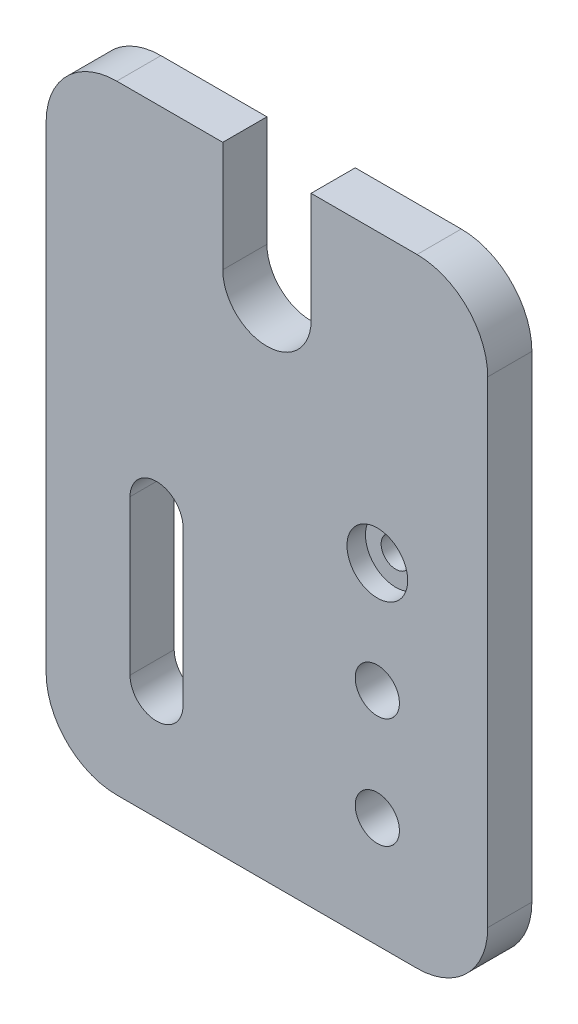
ISO-10303-21;
HEADER;
FILE_DESCRIPTION(('STEP AP214'),'2;1');
FILE_NAME('part.step','',(''),(''),'','','');
FILE_SCHEMA(('AUTOMOTIVE_DESIGN { 1 0 10303 214 1 1 1 1 }'));
ENDSEC;
DATA;
#1=APPLICATION_CONTEXT('core data for automotive mechanical design processes');
#2=APPLICATION_PROTOCOL_DEFINITION('international standard','automotive_design',2000,#1);
#3=PRODUCT_CONTEXT('',#1,'mechanical');
#4=PRODUCT('Part','Part','',(#3));
#5=PRODUCT_RELATED_PRODUCT_CATEGORY('part','',(#4));
#6=PRODUCT_DEFINITION_FORMATION('','',#4);
#7=PRODUCT_DEFINITION_CONTEXT('part definition',#1,'design');
#8=PRODUCT_DEFINITION('design','',#6,#7);
#9=PRODUCT_DEFINITION_SHAPE('','',#8);
#10=(LENGTH_UNIT() NAMED_UNIT(*) SI_UNIT(.MILLI.,.METRE.));
#11=(NAMED_UNIT(*) PLANE_ANGLE_UNIT() SI_UNIT($,.RADIAN.));
#12=(NAMED_UNIT(*) SI_UNIT($,.STERADIAN.) SOLID_ANGLE_UNIT());
#13=UNCERTAINTY_MEASURE_WITH_UNIT(LENGTH_MEASURE(1.E-05),#10,'distance_accuracy_value','');
#14=(GEOMETRIC_REPRESENTATION_CONTEXT(3) GLOBAL_UNCERTAINTY_ASSIGNED_CONTEXT((#13)) GLOBAL_UNIT_ASSIGNED_CONTEXT((#10,
#11,#12)) REPRESENTATION_CONTEXT('',''));
#15=CARTESIAN_POINT('',(0.,0.,0.));
#16=DIRECTION('',(0.,0.,1.));
#17=DIRECTION('',(1.,0.,0.));
#18=AXIS2_PLACEMENT_3D('',#15,#16,#17);
#19=CARTESIAN_POINT('',(-63.5,88.9,6.35));
#20=DIRECTION('',(0.,-1.,0.));
#21=DIRECTION('',(0.,0.,-1.));
#22=AXIS2_PLACEMENT_3D('',#19,#20,#21);
#23=PLANE('',#22);
#24=DIRECTION('',(-1.,0.,0.));
#25=VECTOR('',#24,1.);
#26=CARTESIAN_POINT('',(-63.5,88.9,-6.35));
#27=LINE('',#26,#25);
#28=CARTESIAN_POINT('',(43.18,88.9,-6.35));
#29=VERTEX_POINT('',#28);
#30=CARTESIAN_POINT('',(12.7,88.9,-6.35));
#31=VERTEX_POINT('',#30);
#32=EDGE_CURVE('E230',#29,#31,#27,.T.);
#33=ORIENTED_EDGE('',*,*,#32,.T.);
#34=DIRECTION('',(0.,0.,1.));
#35=VECTOR('',#34,1.);
#36=CARTESIAN_POINT('',(12.7,88.9,-6.35));
#37=LINE('',#36,#35);
#38=CARTESIAN_POINT('',(12.7,88.9,6.35));
#39=VERTEX_POINT('',#38);
#40=EDGE_CURVE('E212',#31,#39,#37,.T.);
#41=ORIENTED_EDGE('',*,*,#40,.T.);
#42=DIRECTION('',(-1.,0.,0.));
#43=VECTOR('',#42,1.);
#44=CARTESIAN_POINT('',(-63.5,88.9,6.35));
#45=LINE('',#44,#43);
#46=CARTESIAN_POINT('',(43.18,88.9,6.35));
#47=VERTEX_POINT('',#46);
#48=EDGE_CURVE('E243',#47,#39,#45,.T.);
#49=ORIENTED_EDGE('',*,*,#48,.F.);
#50=DIRECTION('',(0.,0.,-1.));
#51=VECTOR('',#50,1.);
#52=CARTESIAN_POINT('',(43.18,88.9,6.35));
#53=LINE('',#52,#51);
#54=EDGE_CURVE('E273',#47,#29,#53,.T.);
#55=ORIENTED_EDGE('',*,*,#54,.T.);
#56=EDGE_LOOP('',(#33,#41,#49,#55));
#57=FACE_BOUND('',#56,.T.);
#58=ADVANCED_FACE('F24',(#57),#23,.F.);
#59=CARTESIAN_POINT('',(-63.5,88.9,6.35));
#60=DIRECTION('',(1.,0.,0.));
#61=DIRECTION('',(0.,1.,0.));
#62=AXIS2_PLACEMENT_3D('',#59,#60,#61);
#63=PLANE('',#62);
#64=DIRECTION('',(0.,-1.,0.));
#65=VECTOR('',#64,1.);
#66=CARTESIAN_POINT('',(-63.5,88.9,-6.35));
#67=LINE('',#66,#65);
#68=CARTESIAN_POINT('',(-63.5,68.58,-6.35));
#69=VERTEX_POINT('',#68);
#70=CARTESIAN_POINT('',(-63.5,-68.58,-6.35));
#71=VERTEX_POINT('',#70);
#72=EDGE_CURVE('E215',#69,#71,#67,.T.);
#73=ORIENTED_EDGE('',*,*,#72,.T.);
#74=DIRECTION('',(0.,0.,-1.));
#75=VECTOR('',#74,1.);
#76=CARTESIAN_POINT('',(-63.5,-68.58,6.35));
#77=LINE('',#76,#75);
#78=CARTESIAN_POINT('',(-63.5,-68.58,6.35));
#79=VERTEX_POINT('',#78);
#80=EDGE_CURVE('E263',#71,#79,#77,.F.);
#81=ORIENTED_EDGE('',*,*,#80,.T.);
#82=DIRECTION('',(0.,-1.,0.));
#83=VECTOR('',#82,1.);
#84=CARTESIAN_POINT('',(-63.5,88.9,6.35));
#85=LINE('',#84,#83);
#86=CARTESIAN_POINT('',(-63.5,68.58,6.35));
#87=VERTEX_POINT('',#86);
#88=EDGE_CURVE('E233',#87,#79,#85,.T.);
#89=ORIENTED_EDGE('',*,*,#88,.F.);
#90=DIRECTION('',(0.,0.,-1.));
#91=VECTOR('',#90,1.);
#92=CARTESIAN_POINT('',(-63.5,68.58,6.35));
#93=LINE('',#92,#91);
#94=EDGE_CURVE('E260',#87,#69,#93,.T.);
#95=ORIENTED_EDGE('',*,*,#94,.T.);
#96=EDGE_LOOP('',(#73,#81,#89,#95));
#97=FACE_BOUND('',#96,.T.);
#98=ADVANCED_FACE('F26',(#97),#63,.F.);
#99=CARTESIAN_POINT('',(-63.5,-88.9,6.35));
#100=DIRECTION('',(0.,1.,0.));
#101=DIRECTION('',(0.,0.,1.));
#102=AXIS2_PLACEMENT_3D('',#99,#100,#101);
#103=PLANE('',#102);
#104=DIRECTION('',(1.,0.,0.));
#105=VECTOR('',#104,1.);
#106=CARTESIAN_POINT('',(-63.5,-88.9,6.35));
#107=LINE('',#106,#105);
#108=CARTESIAN_POINT('',(-43.18,-88.9,6.35));
#109=VERTEX_POINT('',#108);
#110=CARTESIAN_POINT('',(43.18,-88.9,6.35));
#111=VERTEX_POINT('',#110);
#112=EDGE_CURVE('E236',#109,#111,#107,.T.);
#113=ORIENTED_EDGE('',*,*,#112,.F.);
#114=DIRECTION('',(0.,0.,-1.));
#115=VECTOR('',#114,1.);
#116=CARTESIAN_POINT('',(-43.18,-88.9,6.35));
#117=LINE('',#116,#115);
#118=CARTESIAN_POINT('',(-43.18,-88.9,-6.35));
#119=VERTEX_POINT('',#118);
#120=EDGE_CURVE('E248',#109,#119,#117,.T.);
#121=ORIENTED_EDGE('',*,*,#120,.T.);
#122=DIRECTION('',(1.,0.,0.));
#123=VECTOR('',#122,1.);
#124=CARTESIAN_POINT('',(-63.5,-88.9,-6.35));
#125=LINE('',#124,#123);
#126=CARTESIAN_POINT('',(43.18,-88.9,-6.35));
#127=VERTEX_POINT('',#126);
#128=EDGE_CURVE('E223',#119,#127,#125,.T.);
#129=ORIENTED_EDGE('',*,*,#128,.T.);
#130=DIRECTION('',(0.,0.,-1.));
#131=VECTOR('',#130,1.);
#132=CARTESIAN_POINT('',(43.18,-88.9,6.35));
#133=LINE('',#132,#131);
#134=EDGE_CURVE('E246',#127,#111,#133,.F.);
#135=ORIENTED_EDGE('',*,*,#134,.T.);
#136=EDGE_LOOP('',(#113,#121,#129,#135));
#137=FACE_BOUND('',#136,.T.);
#138=ADVANCED_FACE('F305',(#137),#103,.F.);
#139=CARTESIAN_POINT('',(63.5,88.9,6.35));
#140=DIRECTION('',(-1.,0.,0.));
#141=DIRECTION('',(0.,-1.,0.));
#142=AXIS2_PLACEMENT_3D('',#139,#140,#141);
#143=PLANE('',#142);
#144=DIRECTION('',(0.,1.,0.));
#145=VECTOR('',#144,1.);
#146=CARTESIAN_POINT('',(63.5,88.9,-6.35));
#147=LINE('',#146,#145);
#148=CARTESIAN_POINT('',(63.5,-68.58,-6.35));
#149=VERTEX_POINT('',#148);
#150=CARTESIAN_POINT('',(63.5,68.58,-6.35));
#151=VERTEX_POINT('',#150);
#152=EDGE_CURVE('E226',#149,#151,#147,.T.);
#153=ORIENTED_EDGE('',*,*,#152,.T.);
#154=DIRECTION('',(0.,0.,-1.));
#155=VECTOR('',#154,1.);
#156=CARTESIAN_POINT('',(63.5,68.58,6.35));
#157=LINE('',#156,#155);
#158=CARTESIAN_POINT('',(63.5,68.58,6.35));
#159=VERTEX_POINT('',#158);
#160=EDGE_CURVE('E11',#151,#159,#157,.F.);
#161=ORIENTED_EDGE('',*,*,#160,.T.);
#162=DIRECTION('',(0.,1.,0.));
#163=VECTOR('',#162,1.);
#164=CARTESIAN_POINT('',(63.5,88.9,6.35));
#165=LINE('',#164,#163);
#166=CARTESIAN_POINT('',(63.5,-68.58,6.35));
#167=VERTEX_POINT('',#166);
#168=EDGE_CURVE('E239',#167,#159,#165,.T.);
#169=ORIENTED_EDGE('',*,*,#168,.F.);
#170=DIRECTION('',(0.,0.,-1.));
#171=VECTOR('',#170,1.);
#172=CARTESIAN_POINT('',(63.5,-68.58,6.35));
#173=LINE('',#172,#171);
#174=EDGE_CURVE('E33',#167,#149,#173,.T.);
#175=ORIENTED_EDGE('',*,*,#174,.T.);
#176=EDGE_LOOP('',(#153,#161,#169,#175));
#177=FACE_BOUND('',#176,.T.);
#178=ADVANCED_FACE('F284',(#177),#143,.F.);
#179=CARTESIAN_POINT('',(-12.7,88.9,6.35));
#180=VERTEX_POINT('',#179);
#181=CARTESIAN_POINT('',(-43.18,88.9,6.35));
#182=VERTEX_POINT('',#181);
#183=EDGE_CURVE('E242',#180,#182,#45,.T.);
#184=ORIENTED_EDGE('',*,*,#183,.F.);
#185=DIRECTION('',(0.,0.,1.));
#186=VECTOR('',#185,1.);
#187=CARTESIAN_POINT('',(-12.7,88.9,-6.35));
#188=LINE('',#187,#186);
#189=CARTESIAN_POINT('',(-12.7,88.9,-6.35));
#190=VERTEX_POINT('',#189);
#191=EDGE_CURVE('E211',#190,#180,#188,.T.);
#192=ORIENTED_EDGE('',*,*,#191,.F.);
#193=CARTESIAN_POINT('',(-43.18,88.9,-6.35));
#194=VERTEX_POINT('',#193);
#195=EDGE_CURVE('E229',#190,#194,#27,.T.);
#196=ORIENTED_EDGE('',*,*,#195,.T.);
#197=DIRECTION('',(0.,0.,-1.));
#198=VECTOR('',#197,1.);
#199=CARTESIAN_POINT('',(-43.18,88.9,6.35));
#200=LINE('',#199,#198);
#201=EDGE_CURVE('E276',#194,#182,#200,.F.);
#202=ORIENTED_EDGE('',*,*,#201,.T.);
#203=EDGE_LOOP('',(#184,#192,#196,#202));
#204=FACE_BOUND('',#203,.T.);
#205=ADVANCED_FACE('F323',(#204),#23,.F.);
#206=CARTESIAN_POINT('',(-63.5,-88.9,6.35));
#207=DIRECTION('',(0.,0.,1.));
#208=DIRECTION('',(1.,0.,0.));
#209=AXIS2_PLACEMENT_3D('',#206,#207,#208);
#210=PLANE('',#209);
#211=CARTESIAN_POINT('',(-31.75,-12.7,6.35));
#212=DIRECTION('',(0.,0.,1.));
#213=DIRECTION('',(1.,0.,0.));
#214=AXIS2_PLACEMENT_3D('',#211,#212,#213);
#215=CIRCLE('',#214,7.62);
#216=CARTESIAN_POINT('',(-24.13,-12.7,6.35));
#217=VERTEX_POINT('',#216);
#218=CARTESIAN_POINT('',(-39.37,-12.7,6.35));
#219=VERTEX_POINT('',#218);
#220=EDGE_CURVE('E40',#217,#219,#215,.T.);
#221=ORIENTED_EDGE('',*,*,#220,.F.);
#222=DIRECTION('',(0.,1.,0.));
#223=VECTOR('',#222,1.);
#224=CARTESIAN_POINT('',(-24.13,-57.15,6.35));
#225=LINE('',#224,#223);
#226=CARTESIAN_POINT('',(-24.13,-57.15,6.35));
#227=VERTEX_POINT('',#226);
#228=EDGE_CURVE('E155',#227,#217,#225,.T.);
#229=ORIENTED_EDGE('',*,*,#228,.F.);
#230=CARTESIAN_POINT('',(-31.75,-57.15,6.35));
#231=DIRECTION('',(0.,0.,1.));
#232=DIRECTION('',(1.,0.,0.));
#233=AXIS2_PLACEMENT_3D('',#230,#231,#232);
#234=CIRCLE('',#233,7.62);
#235=CARTESIAN_POINT('',(-39.37,-57.15,6.35));
#236=VERTEX_POINT('',#235);
#237=EDGE_CURVE('E139',#236,#227,#234,.T.);
#238=ORIENTED_EDGE('',*,*,#237,.F.);
#239=DIRECTION('',(0.,-1.,0.));
#240=VECTOR('',#239,1.);
#241=CARTESIAN_POINT('',(-39.37,-12.7,6.35));
#242=LINE('',#241,#240);
#243=EDGE_CURVE('E148',#219,#236,#242,.T.);
#244=ORIENTED_EDGE('',*,*,#243,.F.);
#245=EDGE_LOOP('',(#221,#229,#238,#244));
#246=FACE_BOUND('',#245,.T.);
#247=CARTESIAN_POINT('',(31.75,6.34999999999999,6.35));
#248=DIRECTION('',(0.,0.,1.));
#249=DIRECTION('',(1.,0.,0.));
#250=AXIS2_PLACEMENT_3D('',#247,#248,#249);
#251=CIRCLE('',#250,8.73125);
#252=CARTESIAN_POINT('',(40.48125,6.34999999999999,6.35));
#253=VERTEX_POINT('',#252);
#254=EDGE_CURVE('E179',#253,#253,#251,.T.);
#255=ORIENTED_EDGE('',*,*,#254,.F.);
#256=EDGE_LOOP('',(#255));
#257=FACE_BOUND('',#256,.T.);
#258=CARTESIAN_POINT('',(31.75,-57.15,6.35));
#259=DIRECTION('',(0.,0.,1.));
#260=DIRECTION('',(1.,0.,0.));
#261=AXIS2_PLACEMENT_3D('',#258,#259,#260);
#262=CIRCLE('',#261,6.35);
#263=CARTESIAN_POINT('',(38.1,-57.15,6.35));
#264=VERTEX_POINT('',#263);
#265=EDGE_CURVE('E182',#264,#264,#262,.T.);
#266=ORIENTED_EDGE('',*,*,#265,.F.);
#267=EDGE_LOOP('',(#266));
#268=FACE_BOUND('',#267,.T.);
#269=CARTESIAN_POINT('',(31.75,-25.4,6.35));
#270=DIRECTION('',(0.,0.,1.));
#271=DIRECTION('',(1.,0.,0.));
#272=AXIS2_PLACEMENT_3D('',#269,#270,#271);
#273=CIRCLE('',#272,6.35);
#274=CARTESIAN_POINT('',(38.1,-25.4,6.35));
#275=VERTEX_POINT('',#274);
#276=EDGE_CURVE('E188',#275,#275,#273,.T.);
#277=ORIENTED_EDGE('',*,*,#276,.F.);
#278=EDGE_LOOP('',(#277));
#279=FACE_BOUND('',#278,.T.);
#280=DIRECTION('',(0.,1.,0.));
#281=VECTOR('',#280,1.);
#282=CARTESIAN_POINT('',(12.7,57.15,6.35));
#283=LINE('',#282,#281);
#284=CARTESIAN_POINT('',(12.7,57.15,6.35));
#285=VERTEX_POINT('',#284);
#286=EDGE_CURVE('E200',#285,#39,#283,.T.);
#287=ORIENTED_EDGE('',*,*,#286,.F.);
#288=CARTESIAN_POINT('',(0.,57.15,6.35));
#289=DIRECTION('',(0.,0.,1.));
#290=DIRECTION('',(1.,0.,0.));
#291=AXIS2_PLACEMENT_3D('',#288,#289,#290);
#292=CIRCLE('',#291,12.7);
#293=CARTESIAN_POINT('',(-12.7,57.15,6.35));
#294=VERTEX_POINT('',#293);
#295=EDGE_CURVE('E197',#294,#285,#292,.T.);
#296=ORIENTED_EDGE('',*,*,#295,.F.);
#297=DIRECTION('',(0.,-1.,0.));
#298=VECTOR('',#297,1.);
#299=CARTESIAN_POINT('',(-12.7,88.9,6.35));
#300=LINE('',#299,#298);
#301=EDGE_CURVE('E194',#180,#294,#300,.T.);
#302=ORIENTED_EDGE('',*,*,#301,.F.);
#303=ORIENTED_EDGE('',*,*,#183,.T.);
#304=CARTESIAN_POINT('',(-43.18,68.58,6.35));
#305=DIRECTION('',(0.,0.,1.));
#306=DIRECTION('',(1.,0.,0.));
#307=AXIS2_PLACEMENT_3D('',#304,#305,#306);
#308=CIRCLE('',#307,20.32);
#309=EDGE_CURVE('E269',#182,#87,#308,.T.);
#310=ORIENTED_EDGE('',*,*,#309,.T.);
#311=ORIENTED_EDGE('',*,*,#88,.T.);
#312=CARTESIAN_POINT('',(-43.18,-68.58,6.35));
#313=DIRECTION('',(0.,0.,1.));
#314=DIRECTION('',(1.,0.,0.));
#315=AXIS2_PLACEMENT_3D('',#312,#313,#314);
#316=CIRCLE('',#315,20.32);
#317=EDGE_CURVE('E271',#79,#109,#316,.T.);
#318=ORIENTED_EDGE('',*,*,#317,.T.);
#319=ORIENTED_EDGE('',*,*,#112,.T.);
#320=CARTESIAN_POINT('',(43.18,-68.58,6.35));
#321=DIRECTION('',(0.,0.,1.));
#322=DIRECTION('',(1.,0.,0.));
#323=AXIS2_PLACEMENT_3D('',#320,#321,#322);
#324=CIRCLE('',#323,20.32);
#325=EDGE_CURVE('E265',#111,#167,#324,.T.);
#326=ORIENTED_EDGE('',*,*,#325,.T.);
#327=ORIENTED_EDGE('',*,*,#168,.T.);
#328=CARTESIAN_POINT('',(43.18,68.58,6.35));
#329=DIRECTION('',(0.,0.,1.));
#330=DIRECTION('',(1.,0.,0.));
#331=AXIS2_PLACEMENT_3D('',#328,#329,#330);
#332=CIRCLE('',#331,20.32);
#333=EDGE_CURVE('E267',#159,#47,#332,.T.);
#334=ORIENTED_EDGE('',*,*,#333,.T.);
#335=ORIENTED_EDGE('',*,*,#48,.T.);
#336=EDGE_LOOP('',(#287,#296,#302,#303,#310,#311,#318,#319,#326,#327,#334,#335));
#337=FACE_BOUND('',#336,.T.);
#338=ADVANCED_FACE('F152',(#246,#257,#268,#279,#337),#210,.T.);
#339=CARTESIAN_POINT('',(-63.5,-88.9,-6.35));
#340=DIRECTION('',(0.,0.,1.));
#341=DIRECTION('',(1.,0.,0.));
#342=AXIS2_PLACEMENT_3D('',#339,#340,#341);
#343=PLANE('',#342);
#344=DIRECTION('',(0.,1.,0.));
#345=VECTOR('',#344,1.);
#346=CARTESIAN_POINT('',(-24.13,-57.15,-6.35));
#347=LINE('',#346,#345);
#348=CARTESIAN_POINT('',(-24.13,-57.15,-6.35));
#349=VERTEX_POINT('',#348);
#350=CARTESIAN_POINT('',(-24.13,-12.7,-6.35));
#351=VERTEX_POINT('',#350);
#352=EDGE_CURVE('E166',#349,#351,#347,.T.);
#353=ORIENTED_EDGE('',*,*,#352,.T.);
#354=CARTESIAN_POINT('',(-31.75,-12.7,-6.35));
#355=DIRECTION('',(0.,0.,1.));
#356=DIRECTION('',(1.,0.,0.));
#357=AXIS2_PLACEMENT_3D('',#354,#355,#356);
#358=CIRCLE('',#357,7.62);
#359=CARTESIAN_POINT('',(-39.37,-12.7,-6.35));
#360=VERTEX_POINT('',#359);
#361=EDGE_CURVE('E157',#351,#360,#358,.T.);
#362=ORIENTED_EDGE('',*,*,#361,.T.);
#363=DIRECTION('',(0.,-1.,0.));
#364=VECTOR('',#363,1.);
#365=CARTESIAN_POINT('',(-39.37,-12.7,-6.35));
#366=LINE('',#365,#364);
#367=CARTESIAN_POINT('',(-39.37,-57.15,-6.35));
#368=VERTEX_POINT('',#367);
#369=EDGE_CURVE('E163',#360,#368,#366,.T.);
#370=ORIENTED_EDGE('',*,*,#369,.T.);
#371=CARTESIAN_POINT('',(-31.75,-57.15,-6.35));
#372=DIRECTION('',(0.,0.,1.));
#373=DIRECTION('',(1.,0.,0.));
#374=AXIS2_PLACEMENT_3D('',#371,#372,#373);
#375=CIRCLE('',#374,7.62);
#376=EDGE_CURVE('E48',#368,#349,#375,.T.);
#377=ORIENTED_EDGE('',*,*,#376,.T.);
#378=EDGE_LOOP('',(#353,#362,#370,#377));
#379=FACE_BOUND('',#378,.T.);
#380=CARTESIAN_POINT('',(31.75,6.34999999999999,-6.35));
#381=DIRECTION('',(0.,0.,1.));
#382=DIRECTION('',(1.,0.,0.));
#383=AXIS2_PLACEMENT_3D('',#380,#381,#382);
#384=CIRCLE('',#383,4.21639999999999);
#385=CARTESIAN_POINT('',(35.9664,6.34999999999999,-6.35));
#386=VERTEX_POINT('',#385);
#387=EDGE_CURVE('E28',#386,#386,#384,.T.);
#388=ORIENTED_EDGE('',*,*,#387,.T.);
#389=EDGE_LOOP('',(#388));
#390=FACE_BOUND('',#389,.T.);
#391=CARTESIAN_POINT('',(31.75,-57.15,-6.35));
#392=DIRECTION('',(0.,0.,1.));
#393=DIRECTION('',(1.,0.,0.));
#394=AXIS2_PLACEMENT_3D('',#391,#392,#393);
#395=CIRCLE('',#394,6.35);
#396=CARTESIAN_POINT('',(38.1,-57.15,-6.35));
#397=VERTEX_POINT('',#396);
#398=EDGE_CURVE('E185',#397,#397,#395,.T.);
#399=ORIENTED_EDGE('',*,*,#398,.T.);
#400=EDGE_LOOP('',(#399));
#401=FACE_BOUND('',#400,.T.);
#402=CARTESIAN_POINT('',(31.75,-25.4,-6.35));
#403=DIRECTION('',(0.,0.,1.));
#404=DIRECTION('',(1.,0.,0.));
#405=AXIS2_PLACEMENT_3D('',#402,#403,#404);
#406=CIRCLE('',#405,6.35);
#407=CARTESIAN_POINT('',(38.1,-25.4,-6.35));
#408=VERTEX_POINT('',#407);
#409=EDGE_CURVE('E191',#408,#408,#406,.T.);
#410=ORIENTED_EDGE('',*,*,#409,.T.);
#411=EDGE_LOOP('',(#410));
#412=FACE_BOUND('',#411,.T.);
#413=CARTESIAN_POINT('',(0.,57.15,-6.35));
#414=DIRECTION('',(0.,0.,1.));
#415=DIRECTION('',(1.,0.,0.));
#416=AXIS2_PLACEMENT_3D('',#413,#414,#415);
#417=CIRCLE('',#416,12.7);
#418=CARTESIAN_POINT('',(-12.7,57.15,-6.35));
#419=VERTEX_POINT('',#418);
#420=CARTESIAN_POINT('',(12.7,57.15,-6.35));
#421=VERTEX_POINT('',#420);
#422=EDGE_CURVE('E205',#419,#421,#417,.T.);
#423=ORIENTED_EDGE('',*,*,#422,.T.);
#424=DIRECTION('',(0.,1.,0.));
#425=VECTOR('',#424,1.);
#426=CARTESIAN_POINT('',(12.7,57.15,-6.35));
#427=LINE('',#426,#425);
#428=EDGE_CURVE('E208',#421,#31,#427,.T.);
#429=ORIENTED_EDGE('',*,*,#428,.T.);
#430=ORIENTED_EDGE('',*,*,#32,.F.);
#431=CARTESIAN_POINT('',(43.18,68.58,-6.35));
#432=DIRECTION('',(0.,0.,1.));
#433=DIRECTION('',(1.,0.,0.));
#434=AXIS2_PLACEMENT_3D('',#431,#432,#433);
#435=CIRCLE('',#434,20.32);
#436=EDGE_CURVE('E253',#29,#151,#435,.F.);
#437=ORIENTED_EDGE('',*,*,#436,.T.);
#438=ORIENTED_EDGE('',*,*,#152,.F.);
#439=CARTESIAN_POINT('',(43.18,-68.58,-6.35));
#440=DIRECTION('',(0.,0.,1.));
#441=DIRECTION('',(1.,0.,0.));
#442=AXIS2_PLACEMENT_3D('',#439,#440,#441);
#443=CIRCLE('',#442,20.32);
#444=EDGE_CURVE('E251',#149,#127,#443,.F.);
#445=ORIENTED_EDGE('',*,*,#444,.T.);
#446=ORIENTED_EDGE('',*,*,#128,.F.);
#447=CARTESIAN_POINT('',(-43.18,-68.58,-6.35));
#448=DIRECTION('',(0.,0.,1.));
#449=DIRECTION('',(1.,0.,0.));
#450=AXIS2_PLACEMENT_3D('',#447,#448,#449);
#451=CIRCLE('',#450,20.32);
#452=EDGE_CURVE('E258',#119,#71,#451,.F.);
#453=ORIENTED_EDGE('',*,*,#452,.T.);
#454=ORIENTED_EDGE('',*,*,#72,.F.);
#455=CARTESIAN_POINT('',(-43.18,68.58,-6.35));
#456=DIRECTION('',(0.,0.,1.));
#457=DIRECTION('',(1.,0.,0.));
#458=AXIS2_PLACEMENT_3D('',#455,#456,#457);
#459=CIRCLE('',#458,20.32);
#460=EDGE_CURVE('E255',#69,#194,#459,.F.);
#461=ORIENTED_EDGE('',*,*,#460,.T.);
#462=ORIENTED_EDGE('',*,*,#195,.F.);
#463=DIRECTION('',(0.,-1.,0.));
#464=VECTOR('',#463,1.);
#465=CARTESIAN_POINT('',(-12.7,88.9,-6.35));
#466=LINE('',#465,#464);
#467=EDGE_CURVE('E202',#190,#419,#466,.T.);
#468=ORIENTED_EDGE('',*,*,#467,.T.);
#469=EDGE_LOOP('',(#423,#429,#430,#437,#438,#445,#446,#453,#454,#461,#462,#468));
#470=FACE_BOUND('',#469,.T.);
#471=ADVANCED_FACE('F289',(#379,#390,#401,#412,#470),#343,.F.);
#472=CARTESIAN_POINT('',(-43.18,-68.58,6.35));
#473=DIRECTION('',(0.,0.,-1.));
#474=DIRECTION('',(-1.,0.,0.));
#475=AXIS2_PLACEMENT_3D('',#472,#473,#474);
#476=CYLINDRICAL_SURFACE('',#475,20.32);
#477=ORIENTED_EDGE('',*,*,#317,.F.);
#478=ORIENTED_EDGE('',*,*,#80,.F.);
#479=ORIENTED_EDGE('',*,*,#452,.F.);
#480=ORIENTED_EDGE('',*,*,#120,.F.);
#481=EDGE_LOOP('',(#477,#478,#479,#480));
#482=FACE_BOUND('',#481,.T.);
#483=ADVANCED_FACE('F314',(#482),#476,.T.);
#484=CARTESIAN_POINT('',(-43.18,68.58,6.35));
#485=DIRECTION('',(0.,0.,-1.));
#486=DIRECTION('',(-1.,0.,0.));
#487=AXIS2_PLACEMENT_3D('',#484,#485,#486);
#488=CYLINDRICAL_SURFACE('',#487,20.32);
#489=ORIENTED_EDGE('',*,*,#309,.F.);
#490=ORIENTED_EDGE('',*,*,#201,.F.);
#491=ORIENTED_EDGE('',*,*,#460,.F.);
#492=ORIENTED_EDGE('',*,*,#94,.F.);
#493=EDGE_LOOP('',(#489,#490,#491,#492));
#494=FACE_BOUND('',#493,.T.);
#495=ADVANCED_FACE('F317',(#494),#488,.T.);
#496=CARTESIAN_POINT('',(43.18,68.58,6.35));
#497=DIRECTION('',(0.,0.,-1.));
#498=DIRECTION('',(-1.,0.,0.));
#499=AXIS2_PLACEMENT_3D('',#496,#497,#498);
#500=CYLINDRICAL_SURFACE('',#499,20.32);
#501=ORIENTED_EDGE('',*,*,#333,.F.);
#502=ORIENTED_EDGE('',*,*,#160,.F.);
#503=ORIENTED_EDGE('',*,*,#436,.F.);
#504=ORIENTED_EDGE('',*,*,#54,.F.);
#505=EDGE_LOOP('',(#501,#502,#503,#504));
#506=FACE_BOUND('',#505,.T.);
#507=ADVANCED_FACE('F295',(#506),#500,.T.);
#508=CARTESIAN_POINT('',(43.18,-68.58,6.35));
#509=DIRECTION('',(0.,0.,-1.));
#510=DIRECTION('',(-1.,0.,0.));
#511=AXIS2_PLACEMENT_3D('',#508,#509,#510);
#512=CYLINDRICAL_SURFACE('',#511,20.32);
#513=ORIENTED_EDGE('',*,*,#325,.F.);
#514=ORIENTED_EDGE('',*,*,#134,.F.);
#515=ORIENTED_EDGE('',*,*,#444,.F.);
#516=ORIENTED_EDGE('',*,*,#174,.F.);
#517=EDGE_LOOP('',(#513,#514,#515,#516));
#518=FACE_BOUND('',#517,.T.);
#519=ADVANCED_FACE('F303',(#518),#512,.T.);
#520=CARTESIAN_POINT('',(12.7,57.15,-6.35));
#521=DIRECTION('',(1.,0.,0.));
#522=DIRECTION('',(0.,0.,-1.));
#523=AXIS2_PLACEMENT_3D('',#520,#521,#522);
#524=PLANE('',#523);
#525=ORIENTED_EDGE('',*,*,#286,.T.);
#526=ORIENTED_EDGE('',*,*,#40,.F.);
#527=ORIENTED_EDGE('',*,*,#428,.F.);
#528=DIRECTION('',(0.,0.,1.));
#529=VECTOR('',#528,1.);
#530=CARTESIAN_POINT('',(12.7,57.15,-6.35));
#531=LINE('',#530,#529);
#532=EDGE_CURVE('E216',#421,#285,#531,.T.);
#533=ORIENTED_EDGE('',*,*,#532,.T.);
#534=EDGE_LOOP('',(#525,#526,#527,#533));
#535=FACE_BOUND('',#534,.T.);
#536=ADVANCED_FACE('F332',(#535),#524,.F.);
#537=CARTESIAN_POINT('',(0.,57.15,-6.35));
#538=DIRECTION('',(0.,0.,1.));
#539=DIRECTION('',(1.,0.,0.));
#540=AXIS2_PLACEMENT_3D('',#537,#538,#539);
#541=CYLINDRICAL_SURFACE('',#540,12.7);
#542=ORIENTED_EDGE('',*,*,#295,.T.);
#543=ORIENTED_EDGE('',*,*,#532,.F.);
#544=ORIENTED_EDGE('',*,*,#422,.F.);
#545=DIRECTION('',(0.,0.,1.));
#546=VECTOR('',#545,1.);
#547=CARTESIAN_POINT('',(-12.7,57.15,-6.35));
#548=LINE('',#547,#546);
#549=EDGE_CURVE('E218',#419,#294,#548,.T.);
#550=ORIENTED_EDGE('',*,*,#549,.T.);
#551=EDGE_LOOP('',(#542,#543,#544,#550));
#552=FACE_BOUND('',#551,.T.);
#553=ADVANCED_FACE('F329',(#552),#541,.F.);
#554=CARTESIAN_POINT('',(-12.7,88.9,-6.35));
#555=DIRECTION('',(-1.,0.,0.));
#556=DIRECTION('',(0.,-1.,0.));
#557=AXIS2_PLACEMENT_3D('',#554,#555,#556);
#558=PLANE('',#557);
#559=ORIENTED_EDGE('',*,*,#301,.T.);
#560=ORIENTED_EDGE('',*,*,#549,.F.);
#561=ORIENTED_EDGE('',*,*,#467,.F.);
#562=ORIENTED_EDGE('',*,*,#191,.T.);
#563=EDGE_LOOP('',(#559,#560,#561,#562));
#564=FACE_BOUND('',#563,.T.);
#565=ADVANCED_FACE('F326',(#564),#558,.F.);
#566=CARTESIAN_POINT('',(31.75,-25.4,-6.35));
#567=DIRECTION('',(0.,0.,1.));
#568=DIRECTION('',(1.,0.,0.));
#569=AXIS2_PLACEMENT_3D('',#566,#567,#568);
#570=CYLINDRICAL_SURFACE('',#569,6.35);
#571=ORIENTED_EDGE('',*,*,#409,.F.);
#572=EDGE_LOOP('',(#571));
#573=FACE_BOUND('',#572,.T.);
#574=ORIENTED_EDGE('',*,*,#276,.T.);
#575=EDGE_LOOP('',(#574));
#576=FACE_BOUND('',#575,.T.);
#577=ADVANCED_FACE('F417',(#573,#576),#570,.F.);
#578=CARTESIAN_POINT('',(31.75,-57.15,-6.35));
#579=DIRECTION('',(0.,0.,1.));
#580=DIRECTION('',(1.,0.,0.));
#581=AXIS2_PLACEMENT_3D('',#578,#579,#580);
#582=CYLINDRICAL_SURFACE('',#581,6.35);
#583=ORIENTED_EDGE('',*,*,#398,.F.);
#584=EDGE_LOOP('',(#583));
#585=FACE_BOUND('',#584,.T.);
#586=ORIENTED_EDGE('',*,*,#265,.T.);
#587=EDGE_LOOP('',(#586));
#588=FACE_BOUND('',#587,.T.);
#589=ADVANCED_FACE('F424',(#585,#588),#582,.F.);
#590=CARTESIAN_POINT('',(31.75,6.34999999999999,6.35));
#591=DIRECTION('',(0.,0.,1.));
#592=DIRECTION('',(1.,0.,0.));
#593=AXIS2_PLACEMENT_3D('',#590,#591,#592);
#594=CYLINDRICAL_SURFACE('',#593,4.21639999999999);
#595=CARTESIAN_POINT('',(31.75,6.34999999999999,1.0414));
#596=DIRECTION('',(0.,0.,1.));
#597=DIRECTION('',(1.,0.,0.));
#598=AXIS2_PLACEMENT_3D('',#595,#596,#597);
#599=CIRCLE('',#598,4.21639999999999);
#600=CARTESIAN_POINT('',(35.9664,6.34999999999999,1.0414));
#601=VERTEX_POINT('',#600);
#602=EDGE_CURVE('E171',#601,#601,#599,.T.);
#603=ORIENTED_EDGE('',*,*,#602,.T.);
#604=EDGE_LOOP('',(#603));
#605=FACE_BOUND('',#604,.T.);
#606=ORIENTED_EDGE('',*,*,#387,.F.);
#607=EDGE_LOOP('',(#606));
#608=FACE_BOUND('',#607,.T.);
#609=ADVANCED_FACE('F431',(#605,#608),#594,.F.);
#610=CARTESIAN_POINT('',(31.75,6.34999999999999,6.35));
#611=DIRECTION('',(0.,0.,1.));
#612=DIRECTION('',(1.,0.,0.));
#613=AXIS2_PLACEMENT_3D('',#610,#611,#612);
#614=CYLINDRICAL_SURFACE('',#613,8.73125);
#615=CARTESIAN_POINT('',(31.75,6.34999999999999,1.0414));
#616=DIRECTION('',(0.,0.,1.));
#617=DIRECTION('',(1.,0.,0.));
#618=AXIS2_PLACEMENT_3D('',#615,#616,#617);
#619=CIRCLE('',#618,8.73125);
#620=CARTESIAN_POINT('',(40.48125,6.34999999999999,1.0414));
#621=VERTEX_POINT('',#620);
#622=EDGE_CURVE('E176',#621,#621,#619,.T.);
#623=ORIENTED_EDGE('',*,*,#622,.F.);
#624=EDGE_LOOP('',(#623));
#625=FACE_BOUND('',#624,.T.);
#626=ORIENTED_EDGE('',*,*,#254,.T.);
#627=EDGE_LOOP('',(#626));
#628=FACE_BOUND('',#627,.T.);
#629=ADVANCED_FACE('F439',(#625,#628),#614,.F.);
#630=CARTESIAN_POINT('',(35.9664,6.34999999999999,1.0414));
#631=DIRECTION('',(0.,0.,-1.));
#632=DIRECTION('',(-1.,0.,0.));
#633=AXIS2_PLACEMENT_3D('',#630,#631,#632);
#634=PLANE('',#633);
#635=ORIENTED_EDGE('',*,*,#602,.F.);
#636=EDGE_LOOP('',(#635));
#637=FACE_BOUND('',#636,.T.);
#638=ORIENTED_EDGE('',*,*,#622,.T.);
#639=EDGE_LOOP('',(#638));
#640=FACE_BOUND('',#639,.T.);
#641=ADVANCED_FACE('F447',(#637,#640),#634,.F.);
#642=CARTESIAN_POINT('',(-31.75,-12.7,-6.35));
#643=DIRECTION('',(0.,0.,1.));
#644=DIRECTION('',(1.,0.,0.));
#645=AXIS2_PLACEMENT_3D('',#642,#643,#644);
#646=CYLINDRICAL_SURFACE('',#645,7.62);
#647=ORIENTED_EDGE('',*,*,#220,.T.);
#648=DIRECTION('',(0.,0.,1.));
#649=VECTOR('',#648,1.);
#650=CARTESIAN_POINT('',(-39.37,-12.7,-6.35));
#651=LINE('',#650,#649);
#652=EDGE_CURVE('E145',#360,#219,#651,.T.);
#653=ORIENTED_EDGE('',*,*,#652,.F.);
#654=ORIENTED_EDGE('',*,*,#361,.F.);
#655=DIRECTION('',(0.,0.,1.));
#656=VECTOR('',#655,1.);
#657=CARTESIAN_POINT('',(-24.13,-12.7,-6.35));
#658=LINE('',#657,#656);
#659=EDGE_CURVE('E169',#351,#217,#658,.T.);
#660=ORIENTED_EDGE('',*,*,#659,.T.);
#661=EDGE_LOOP('',(#647,#653,#654,#660));
#662=FACE_BOUND('',#661,.T.);
#663=ADVANCED_FACE('F454',(#662),#646,.F.);
#664=CARTESIAN_POINT('',(-24.13,-57.15,-6.35));
#665=DIRECTION('',(1.,0.,0.));
#666=DIRECTION('',(0.,1.,0.));
#667=AXIS2_PLACEMENT_3D('',#664,#665,#666);
#668=PLANE('',#667);
#669=ORIENTED_EDGE('',*,*,#228,.T.);
#670=ORIENTED_EDGE('',*,*,#659,.F.);
#671=ORIENTED_EDGE('',*,*,#352,.F.);
#672=DIRECTION('',(0.,0.,1.));
#673=VECTOR('',#672,1.);
#674=CARTESIAN_POINT('',(-24.13,-57.15,-6.35));
#675=LINE('',#674,#673);
#676=EDGE_CURVE('E144',#349,#227,#675,.T.);
#677=ORIENTED_EDGE('',*,*,#676,.T.);
#678=EDGE_LOOP('',(#669,#670,#671,#677));
#679=FACE_BOUND('',#678,.T.);
#680=ADVANCED_FACE('F461',(#679),#668,.F.);
#681=CARTESIAN_POINT('',(-31.75,-57.15,-6.35));
#682=DIRECTION('',(0.,0.,1.));
#683=DIRECTION('',(1.,0.,0.));
#684=AXIS2_PLACEMENT_3D('',#681,#682,#683);
#685=CYLINDRICAL_SURFACE('',#684,7.62);
#686=ORIENTED_EDGE('',*,*,#237,.T.);
#687=ORIENTED_EDGE('',*,*,#676,.F.);
#688=ORIENTED_EDGE('',*,*,#376,.F.);
#689=DIRECTION('',(0.,0.,1.));
#690=VECTOR('',#689,1.);
#691=CARTESIAN_POINT('',(-39.37,-57.15,-6.35));
#692=LINE('',#691,#690);
#693=EDGE_CURVE('E135',#368,#236,#692,.T.);
#694=ORIENTED_EDGE('',*,*,#693,.T.);
#695=EDGE_LOOP('',(#686,#687,#688,#694));
#696=FACE_BOUND('',#695,.T.);
#697=ADVANCED_FACE('F137',(#696),#685,.F.);
#698=CARTESIAN_POINT('',(-39.37,-12.7,-6.35));
#699=DIRECTION('',(-1.,0.,0.));
#700=DIRECTION('',(0.,0.,1.));
#701=AXIS2_PLACEMENT_3D('',#698,#699,#700);
#702=PLANE('',#701);
#703=ORIENTED_EDGE('',*,*,#243,.T.);
#704=ORIENTED_EDGE('',*,*,#693,.F.);
#705=ORIENTED_EDGE('',*,*,#369,.F.);
#706=ORIENTED_EDGE('',*,*,#652,.T.);
#707=EDGE_LOOP('',(#703,#704,#705,#706));
#708=FACE_BOUND('',#707,.T.);
#709=ADVANCED_FACE('F149',(#708),#702,.F.);
#710=CLOSED_SHELL('',(#58,#98,#138,#178,#205,#338,#471,#483,#495,#507,#519,#536,#553,#565,#577,
#589,#609,#629,#641,#663,#680,#697,#709));
#711=MANIFOLD_SOLID_BREP('B2',#710);
#712=ADVANCED_BREP_SHAPE_REPRESENTATION('',(#18,#711),#14);
#713=SHAPE_DEFINITION_REPRESENTATION(#9,#712);
ENDSEC;
END-ISO-10303-21;
